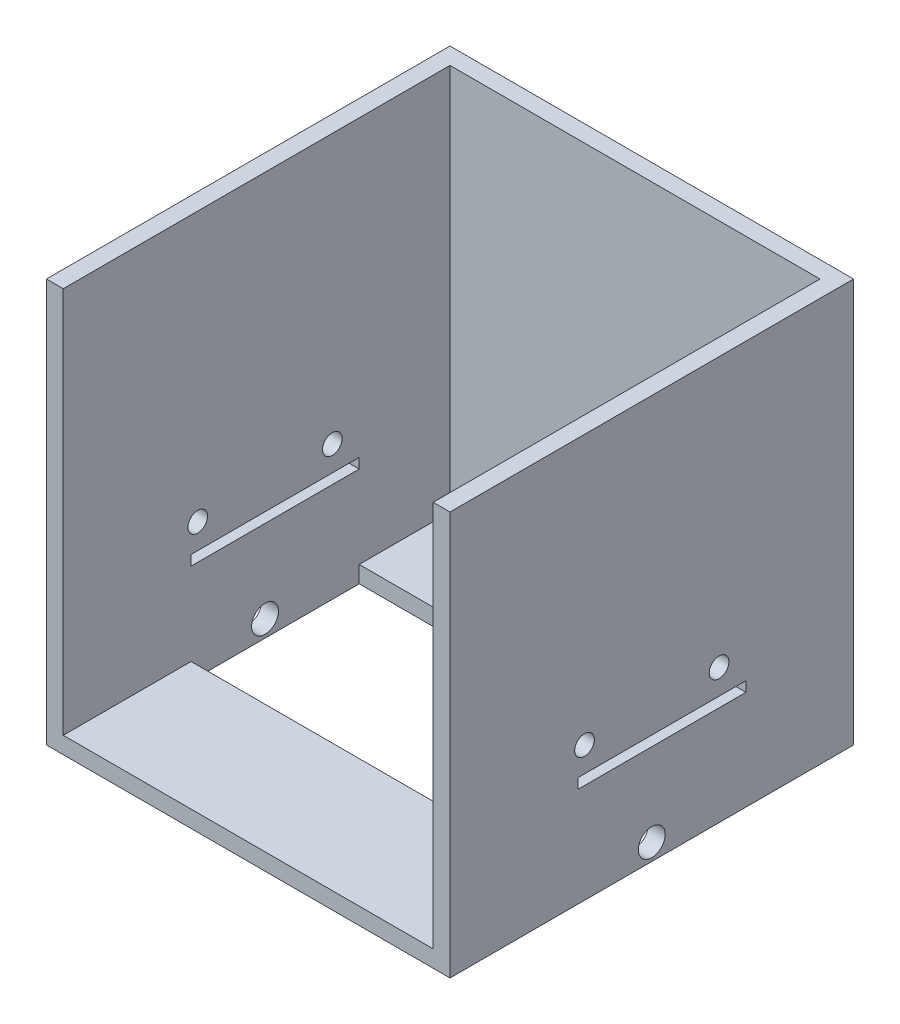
ISO-10303-21;
HEADER;
FILE_DESCRIPTION(('STEP AP214'),'2;1');
FILE_NAME('part.step','',(''),(''),'','','');
FILE_SCHEMA(('AUTOMOTIVE_DESIGN { 1 0 10303 214 1 1 1 1 }'));
ENDSEC;
DATA;
#1=APPLICATION_CONTEXT('core data for automotive mechanical design processes');
#2=APPLICATION_PROTOCOL_DEFINITION('international standard','automotive_design',2000,#1);
#3=PRODUCT_CONTEXT('',#1,'mechanical');
#4=PRODUCT('Part','Part','',(#3));
#5=PRODUCT_RELATED_PRODUCT_CATEGORY('part','',(#4));
#6=PRODUCT_DEFINITION_FORMATION('','',#4);
#7=PRODUCT_DEFINITION_CONTEXT('part definition',#1,'design');
#8=PRODUCT_DEFINITION('design','',#6,#7);
#9=PRODUCT_DEFINITION_SHAPE('','',#8);
#10=(LENGTH_UNIT() NAMED_UNIT(*) SI_UNIT(.MILLI.,.METRE.));
#11=(NAMED_UNIT(*) PLANE_ANGLE_UNIT() SI_UNIT($,.RADIAN.));
#12=(NAMED_UNIT(*) SI_UNIT($,.STERADIAN.) SOLID_ANGLE_UNIT());
#13=UNCERTAINTY_MEASURE_WITH_UNIT(LENGTH_MEASURE(1.E-05),#10,'distance_accuracy_value','');
#14=(GEOMETRIC_REPRESENTATION_CONTEXT(3) GLOBAL_UNCERTAINTY_ASSIGNED_CONTEXT((#13)) GLOBAL_UNIT_ASSIGNED_CONTEXT((#10,
#11,#12)) REPRESENTATION_CONTEXT('',''));
#15=CARTESIAN_POINT('',(0.,0.,0.));
#16=DIRECTION('',(0.,0.,1.));
#17=DIRECTION('',(1.,0.,0.));
#18=AXIS2_PLACEMENT_3D('',#15,#16,#17);
#19=CARTESIAN_POINT('',(60.,4.99819999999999,0.));
#20=DIRECTION('',(-1.,0.,0.));
#21=DIRECTION('',(0.,0.,1.));
#22=AXIS2_PLACEMENT_3D('',#19,#20,#21);
#23=CYLINDRICAL_SURFACE('',#22,4.);
#24=CARTESIAN_POINT('',(60.,4.99819999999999,0.));
#25=DIRECTION('',(-1.,0.,0.));
#26=DIRECTION('',(0.,0.,1.));
#27=AXIS2_PLACEMENT_3D('',#24,#25,#26);
#28=CIRCLE('',#27,4.);
#29=CARTESIAN_POINT('',(60.,4.99819999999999,3.99999999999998));
#30=VERTEX_POINT('',#29);
#31=EDGE_CURVE('E377',#30,#30,#28,.T.);
#32=CARTESIAN_POINT('',(55.,4.99819999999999,0.));
#33=DIRECTION('',(1.,0.,0.));
#34=DIRECTION('',(0.,0.,-1.));
#35=AXIS2_PLACEMENT_3D('',#32,#33,#34);
#36=CIRCLE('',#35,4.);
#37=CARTESIAN_POINT('',(55.,4.99819999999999,3.99999999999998));
#38=VERTEX_POINT('',#37);
#39=EDGE_CURVE('E380',#38,#38,#36,.T.);
#40=CARTESIAN_POINT('',(60.,4.99819999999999,3.99999999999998));
#41=CARTESIAN_POINT('',(59.9479166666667,4.99819999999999,3.99999999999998));
#42=CARTESIAN_POINT('',(59.8958333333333,4.99819999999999,3.99999999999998));
#43=CARTESIAN_POINT('',(59.7916666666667,4.99819999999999,3.99999999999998));
#44=CARTESIAN_POINT('',(59.7395833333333,4.99819999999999,3.99999999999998));
#45=CARTESIAN_POINT('',(59.6354166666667,4.99819999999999,3.99999999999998));
#46=CARTESIAN_POINT('',(59.5833333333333,4.99819999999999,3.99999999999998));
#47=CARTESIAN_POINT('',(59.4791666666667,4.99819999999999,3.99999999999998));
#48=CARTESIAN_POINT('',(59.4270833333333,4.99819999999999,3.99999999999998));
#49=CARTESIAN_POINT('',(59.3229166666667,4.99819999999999,3.99999999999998));
#50=CARTESIAN_POINT('',(59.2708333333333,4.99819999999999,3.99999999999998));
#51=CARTESIAN_POINT('',(59.1666666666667,4.99819999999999,3.99999999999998));
#52=CARTESIAN_POINT('',(59.1145833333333,4.99819999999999,3.99999999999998));
#53=CARTESIAN_POINT('',(59.0104166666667,4.99819999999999,3.99999999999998));
#54=CARTESIAN_POINT('',(58.9583333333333,4.99819999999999,3.99999999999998));
#55=CARTESIAN_POINT('',(58.8541666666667,4.99819999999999,3.99999999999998));
#56=CARTESIAN_POINT('',(58.8020833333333,4.99819999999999,3.99999999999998));
#57=CARTESIAN_POINT('',(58.6979166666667,4.99819999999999,3.99999999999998));
#58=CARTESIAN_POINT('',(58.6458333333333,4.99819999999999,3.99999999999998));
#59=CARTESIAN_POINT('',(58.5416666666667,4.99819999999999,3.99999999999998));
#60=CARTESIAN_POINT('',(58.4895833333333,4.99819999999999,3.99999999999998));
#61=CARTESIAN_POINT('',(58.3854166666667,4.99819999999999,3.99999999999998));
#62=CARTESIAN_POINT('',(58.3333333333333,4.99819999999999,3.99999999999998));
#63=CARTESIAN_POINT('',(58.2291666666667,4.99819999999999,3.99999999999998));
#64=CARTESIAN_POINT('',(58.1770833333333,4.99819999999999,3.99999999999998));
#65=CARTESIAN_POINT('',(58.0729166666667,4.99819999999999,3.99999999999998));
#66=CARTESIAN_POINT('',(58.0208333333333,4.99819999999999,3.99999999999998));
#67=CARTESIAN_POINT('',(57.9166666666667,4.99819999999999,3.99999999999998));
#68=CARTESIAN_POINT('',(57.8645833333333,4.99819999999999,3.99999999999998));
#69=CARTESIAN_POINT('',(57.7604166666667,4.99819999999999,3.99999999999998));
#70=CARTESIAN_POINT('',(57.7083333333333,4.99819999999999,3.99999999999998));
#71=CARTESIAN_POINT('',(57.6041666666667,4.99819999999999,3.99999999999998));
#72=CARTESIAN_POINT('',(57.5520833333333,4.99819999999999,3.99999999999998));
#73=CARTESIAN_POINT('',(57.4479166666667,4.99819999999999,3.99999999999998));
#74=CARTESIAN_POINT('',(57.3958333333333,4.99819999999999,3.99999999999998));
#75=CARTESIAN_POINT('',(57.2916666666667,4.99819999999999,3.99999999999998));
#76=CARTESIAN_POINT('',(57.2395833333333,4.99819999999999,3.99999999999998));
#77=CARTESIAN_POINT('',(57.1354166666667,4.99819999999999,3.99999999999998));
#78=CARTESIAN_POINT('',(57.0833333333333,4.99819999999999,3.99999999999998));
#79=CARTESIAN_POINT('',(56.9791666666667,4.99819999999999,3.99999999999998));
#80=CARTESIAN_POINT('',(56.9270833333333,4.99819999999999,3.99999999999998));
#81=CARTESIAN_POINT('',(56.8229166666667,4.99819999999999,3.99999999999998));
#82=CARTESIAN_POINT('',(56.7708333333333,4.99819999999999,3.99999999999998));
#83=CARTESIAN_POINT('',(56.6666666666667,4.99819999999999,3.99999999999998));
#84=CARTESIAN_POINT('',(56.6145833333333,4.99819999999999,3.99999999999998));
#85=CARTESIAN_POINT('',(56.5104166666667,4.99819999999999,3.99999999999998));
#86=CARTESIAN_POINT('',(56.4583333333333,4.99819999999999,3.99999999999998));
#87=CARTESIAN_POINT('',(56.3541666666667,4.99819999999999,3.99999999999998));
#88=CARTESIAN_POINT('',(56.3020833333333,4.99819999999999,3.99999999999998));
#89=CARTESIAN_POINT('',(56.1979166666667,4.99819999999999,3.99999999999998));
#90=CARTESIAN_POINT('',(56.1458333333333,4.99819999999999,3.99999999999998));
#91=CARTESIAN_POINT('',(56.0416666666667,4.99819999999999,3.99999999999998));
#92=CARTESIAN_POINT('',(55.9895833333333,4.99819999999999,3.99999999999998));
#93=CARTESIAN_POINT('',(55.8854166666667,4.99819999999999,3.99999999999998));
#94=CARTESIAN_POINT('',(55.8333333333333,4.99819999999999,3.99999999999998));
#95=CARTESIAN_POINT('',(55.7291666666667,4.99819999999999,3.99999999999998));
#96=CARTESIAN_POINT('',(55.6770833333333,4.99819999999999,3.99999999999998));
#97=CARTESIAN_POINT('',(55.5729166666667,4.99819999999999,3.99999999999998));
#98=CARTESIAN_POINT('',(55.5208333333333,4.99819999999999,3.99999999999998));
#99=CARTESIAN_POINT('',(55.4166666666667,4.99819999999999,3.99999999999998));
#100=CARTESIAN_POINT('',(55.3645833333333,4.99819999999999,3.99999999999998));
#101=CARTESIAN_POINT('',(55.2604166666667,4.99819999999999,3.99999999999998));
#102=CARTESIAN_POINT('',(55.2083333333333,4.99819999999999,3.99999999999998));
#103=CARTESIAN_POINT('',(55.1041666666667,4.99819999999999,3.99999999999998));
#104=CARTESIAN_POINT('',(55.0520833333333,4.99819999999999,3.99999999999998));
#105=CARTESIAN_POINT('',(55.,4.99819999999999,3.99999999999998));
#106=B_SPLINE_CURVE_WITH_KNOTS('',3,(#40,#41,#42,#43,#44,#45,#46,#47,#48,#49,#50,#51,#52,#53,
#54,#55,#56,#57,#58,#59,#60,#61,#62,#63,#64,#65,#66,#67,#68,#69,#70,#71,#72,#73,#74,#75,#76,#77,
#78,#79,#80,#81,#82,#83,#84,#85,#86,#87,#88,#89,#90,#91,#92,#93,#94,#95,#96,#97,#98,#99,#100,
#101,#102,#103,#104,#105),.UNSPECIFIED.,.F.,.F.,(4,2,2,2,2,2,2,2,2,2,2,2,2,2,2,2,2,2,2,2,2,2,2,
2,2,2,2,2,2,2,2,2,4),(0.,0.156250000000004,0.312500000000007,0.468750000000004,
0.625000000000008,0.781250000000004,0.937500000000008,1.09375,1.25000000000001,1.40625,
1.56250000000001,1.71875,1.87500000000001,2.03125000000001,2.18750000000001,2.34375000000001,
2.50000000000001,2.65625000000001,2.81250000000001,2.96875000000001,3.12500000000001,
3.28125000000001,3.43750000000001,3.59375000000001,3.75000000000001,3.90625000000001,
4.06250000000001,4.21875000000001,4.37500000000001,4.53125000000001,4.68750000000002,
4.84375000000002,5.00000000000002),.UNSPECIFIED.);
#107=EDGE_CURVE('BSEAM35',#30,#38,#106,.T.);
#108=ORIENTED_EDGE('',*,*,#31,.F.);
#109=ORIENTED_EDGE('',*,*,#39,.F.);
#110=ORIENTED_EDGE('',*,*,#107,.T.);
#111=ORIENTED_EDGE('',*,*,#107,.F.);
#112=EDGE_LOOP('',(#108,#110,#109,#111));
#113=FACE_BOUND('',#112,.T.);
#114=ADVANCED_FACE('F35',(#113),#23,.F.);
#115=CARTESIAN_POINT('',(0.,4.99999999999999,0.));
#116=DIRECTION('',(0.,-1.,0.));
#117=DIRECTION('',(0.,0.,-1.));
#118=AXIS2_PLACEMENT_3D('',#115,#116,#117);
#119=PLANE('',#118);
#120=DIRECTION('',(0.,0.,-1.));
#121=VECTOR('',#120,1.);
#122=CARTESIAN_POINT('',(55.,4.99999999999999,60.));
#123=LINE('',#122,#121);
#124=CARTESIAN_POINT('',(55.,4.99999999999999,60.));
#125=VERTEX_POINT('',#124);
#126=CARTESIAN_POINT('',(55.,4.99999999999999,22.));
#127=VERTEX_POINT('',#126);
#128=EDGE_CURVE('E195',#125,#127,#123,.T.);
#129=ORIENTED_EDGE('',*,*,#128,.T.);
#130=DIRECTION('',(1.,0.,0.));
#131=VECTOR('',#130,1.);
#132=CARTESIAN_POINT('',(-55.,4.99999999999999,22.));
#133=LINE('',#132,#131);
#134=CARTESIAN_POINT('',(-55.,4.99999999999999,22.));
#135=VERTEX_POINT('',#134);
#136=EDGE_CURVE('E181',#135,#127,#133,.T.);
#137=ORIENTED_EDGE('',*,*,#136,.F.);
#138=DIRECTION('',(0.,0.,1.));
#139=VECTOR('',#138,1.);
#140=CARTESIAN_POINT('',(-55.,4.99999999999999,60.));
#141=LINE('',#140,#139);
#142=CARTESIAN_POINT('',(-55.,4.99999999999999,60.));
#143=VERTEX_POINT('',#142);
#144=EDGE_CURVE('E214',#135,#143,#141,.T.);
#145=ORIENTED_EDGE('',*,*,#144,.T.);
#146=DIRECTION('',(1.,0.,0.));
#147=VECTOR('',#146,1.);
#148=CARTESIAN_POINT('',(-55.,4.99999999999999,60.));
#149=LINE('',#148,#147);
#150=EDGE_CURVE('E196',#143,#125,#149,.T.);
#151=ORIENTED_EDGE('',*,*,#150,.T.);
#152=EDGE_LOOP('',(#129,#137,#145,#151));
#153=FACE_BOUND('',#152,.T.);
#154=ADVANCED_FACE('F344',(#153),#119,.F.);
#155=CARTESIAN_POINT('',(60.,120.,-60.));
#156=DIRECTION('',(-1.,0.,0.));
#157=DIRECTION('',(0.,0.,1.));
#158=AXIS2_PLACEMENT_3D('',#155,#156,#157);
#159=PLANE('',#158);
#160=ORIENTED_EDGE('',*,*,#31,.T.);
#161=EDGE_LOOP('',(#160));
#162=FACE_BOUND('',#161,.T.);
#163=CARTESIAN_POINT('',(60.,40.,-20.));
#164=DIRECTION('',(-1.,0.,0.));
#165=DIRECTION('',(0.,0.,1.));
#166=AXIS2_PLACEMENT_3D('',#163,#164,#165);
#167=CIRCLE('',#166,2.921);
#168=CARTESIAN_POINT('',(60.,40.,-17.079));
#169=VERTEX_POINT('',#168);
#170=EDGE_CURVE('E271',#169,#169,#167,.T.);
#171=ORIENTED_EDGE('',*,*,#170,.T.);
#172=EDGE_LOOP('',(#171));
#173=FACE_BOUND('',#172,.T.);
#174=DIRECTION('',(0.,0.,-1.));
#175=VECTOR('',#174,1.);
#176=CARTESIAN_POINT('',(60.,32.56,-28.));
#177=LINE('',#176,#175);
#178=CARTESIAN_POINT('',(60.,32.56,22.));
#179=VERTEX_POINT('',#178);
#180=CARTESIAN_POINT('',(60.,32.56,-28.));
#181=VERTEX_POINT('',#180);
#182=EDGE_CURVE('E296',#179,#181,#177,.T.);
#183=ORIENTED_EDGE('',*,*,#182,.T.);
#184=DIRECTION('',(0.,-1.,0.));
#185=VECTOR('',#184,1.);
#186=CARTESIAN_POINT('',(60.,29.56,-28.));
#187=LINE('',#186,#185);
#188=CARTESIAN_POINT('',(60.,29.56,-28.));
#189=VERTEX_POINT('',#188);
#190=EDGE_CURVE('E288',#181,#189,#187,.T.);
#191=ORIENTED_EDGE('',*,*,#190,.T.);
#192=DIRECTION('',(0.,0.,1.));
#193=VECTOR('',#192,1.);
#194=CARTESIAN_POINT('',(60.,29.56,-28.));
#195=LINE('',#194,#193);
#196=CARTESIAN_POINT('',(60.,29.56,22.));
#197=VERTEX_POINT('',#196);
#198=EDGE_CURVE('E291',#189,#197,#195,.T.);
#199=ORIENTED_EDGE('',*,*,#198,.T.);
#200=DIRECTION('',(0.,1.,0.));
#201=VECTOR('',#200,1.);
#202=CARTESIAN_POINT('',(60.,29.56,22.));
#203=LINE('',#202,#201);
#204=EDGE_CURVE('E58',#197,#179,#203,.T.);
#205=ORIENTED_EDGE('',*,*,#204,.T.);
#206=EDGE_LOOP('',(#183,#191,#199,#205));
#207=FACE_BOUND('',#206,.T.);
#208=CARTESIAN_POINT('',(60.,40.,20.));
#209=DIRECTION('',(-1.,0.,0.));
#210=DIRECTION('',(0.,0.,1.));
#211=AXIS2_PLACEMENT_3D('',#208,#209,#210);
#212=CIRCLE('',#211,2.92100000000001);
#213=CARTESIAN_POINT('',(60.,40.,22.921));
#214=VERTEX_POINT('',#213);
#215=EDGE_CURVE('E258',#214,#214,#212,.T.);
#216=ORIENTED_EDGE('',*,*,#215,.T.);
#217=EDGE_LOOP('',(#216));
#218=FACE_BOUND('',#217,.T.);
#219=DIRECTION('',(0.,0.,-1.));
#220=VECTOR('',#219,1.);
#221=CARTESIAN_POINT('',(60.,0.,-60.));
#222=LINE('',#221,#220);
#223=CARTESIAN_POINT('',(60.,0.,60.));
#224=VERTEX_POINT('',#223);
#225=CARTESIAN_POINT('',(60.,0.,-60.));
#226=VERTEX_POINT('',#225);
#227=EDGE_CURVE('E217',#224,#226,#222,.T.);
#228=ORIENTED_EDGE('',*,*,#227,.T.);
#229=DIRECTION('',(0.,-1.,0.));
#230=VECTOR('',#229,1.);
#231=CARTESIAN_POINT('',(60.,120.,-60.));
#232=LINE('',#231,#230);
#233=CARTESIAN_POINT('',(60.,120.,-60.));
#234=VERTEX_POINT('',#233);
#235=EDGE_CURVE('E251',#234,#226,#232,.T.);
#236=ORIENTED_EDGE('',*,*,#235,.F.);
#237=DIRECTION('',(0.,0.,-1.));
#238=VECTOR('',#237,1.);
#239=CARTESIAN_POINT('',(60.,120.,-60.));
#240=LINE('',#239,#238);
#241=CARTESIAN_POINT('',(60.,120.,60.));
#242=VERTEX_POINT('',#241);
#243=EDGE_CURVE('E223',#242,#234,#240,.T.);
#244=ORIENTED_EDGE('',*,*,#243,.F.);
#245=DIRECTION('',(0.,-1.,0.));
#246=VECTOR('',#245,1.);
#247=CARTESIAN_POINT('',(60.,120.,60.));
#248=LINE('',#247,#246);
#249=EDGE_CURVE('E235',#242,#224,#248,.T.);
#250=ORIENTED_EDGE('',*,*,#249,.T.);
#251=EDGE_LOOP('',(#228,#236,#244,#250));
#252=FACE_BOUND('',#251,.T.);
#253=ADVANCED_FACE('F37',(#162,#173,#207,#218,#252),#159,.F.);
#254=CARTESIAN_POINT('',(-60.,120.,-60.));
#255=DIRECTION('',(0.,0.,1.));
#256=DIRECTION('',(1.,0.,0.));
#257=AXIS2_PLACEMENT_3D('',#254,#255,#256);
#258=PLANE('',#257);
#259=DIRECTION('',(-1.,0.,0.));
#260=VECTOR('',#259,1.);
#261=CARTESIAN_POINT('',(-60.,0.,-60.));
#262=LINE('',#261,#260);
#263=CARTESIAN_POINT('',(-60.,0.,-60.));
#264=VERTEX_POINT('',#263);
#265=EDGE_CURVE('E238',#226,#264,#262,.T.);
#266=ORIENTED_EDGE('',*,*,#265,.T.);
#267=DIRECTION('',(0.,-1.,0.));
#268=VECTOR('',#267,1.);
#269=CARTESIAN_POINT('',(-60.,120.,-60.));
#270=LINE('',#269,#268);
#271=CARTESIAN_POINT('',(-60.,120.,-60.));
#272=VERTEX_POINT('',#271);
#273=EDGE_CURVE('E248',#272,#264,#270,.T.);
#274=ORIENTED_EDGE('',*,*,#273,.F.);
#275=DIRECTION('',(-1.,0.,0.));
#276=VECTOR('',#275,1.);
#277=CARTESIAN_POINT('',(-60.,120.,-60.));
#278=LINE('',#277,#276);
#279=EDGE_CURVE('E226',#234,#272,#278,.T.);
#280=ORIENTED_EDGE('',*,*,#279,.F.);
#281=ORIENTED_EDGE('',*,*,#235,.T.);
#282=EDGE_LOOP('',(#266,#274,#280,#281));
#283=FACE_BOUND('',#282,.T.);
#284=ADVANCED_FACE('F415',(#283),#258,.F.);
#285=CARTESIAN_POINT('',(-60.,120.,-60.));
#286=DIRECTION('',(1.,0.,0.));
#287=DIRECTION('',(0.,0.,-1.));
#288=AXIS2_PLACEMENT_3D('',#285,#286,#287);
#289=PLANE('',#288);
#290=CARTESIAN_POINT('',(-60.,4.99819999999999,0.));
#291=DIRECTION('',(-1.,0.,0.));
#292=DIRECTION('',(0.,0.,1.));
#293=AXIS2_PLACEMENT_3D('',#290,#291,#292);
#294=CIRCLE('',#293,4.);
#295=CARTESIAN_POINT('',(-60.,4.99819999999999,3.99999999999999));
#296=VERTEX_POINT('',#295);
#297=EDGE_CURVE('E376',#296,#296,#294,.T.);
#298=ORIENTED_EDGE('',*,*,#297,.F.);
#299=EDGE_LOOP('',(#298));
#300=FACE_BOUND('',#299,.T.);
#301=CARTESIAN_POINT('',(-60.,40.,-20.));
#302=DIRECTION('',(-1.,0.,0.));
#303=DIRECTION('',(0.,0.,1.));
#304=AXIS2_PLACEMENT_3D('',#301,#302,#303);
#305=CIRCLE('',#304,2.921);
#306=CARTESIAN_POINT('',(-60.,40.,-17.079));
#307=VERTEX_POINT('',#306);
#308=EDGE_CURVE('E278',#307,#307,#305,.T.);
#309=ORIENTED_EDGE('',*,*,#308,.F.);
#310=EDGE_LOOP('',(#309));
#311=FACE_BOUND('',#310,.T.);
#312=DIRECTION('',(0.,0.,1.));
#313=VECTOR('',#312,1.);
#314=CARTESIAN_POINT('',(-60.,29.56,-28.));
#315=LINE('',#314,#313);
#316=CARTESIAN_POINT('',(-60.,29.56,-28.));
#317=VERTEX_POINT('',#316);
#318=CARTESIAN_POINT('',(-60.,29.56,22.));
#319=VERTEX_POINT('',#318);
#320=EDGE_CURVE('E301',#317,#319,#315,.T.);
#321=ORIENTED_EDGE('',*,*,#320,.F.);
#322=DIRECTION('',(0.,-1.,0.));
#323=VECTOR('',#322,1.);
#324=CARTESIAN_POINT('',(-60.,29.56,-28.));
#325=LINE('',#324,#323);
#326=CARTESIAN_POINT('',(-60.,32.56,-28.));
#327=VERTEX_POINT('',#326);
#328=EDGE_CURVE('E275',#327,#317,#325,.T.);
#329=ORIENTED_EDGE('',*,*,#328,.F.);
#330=DIRECTION('',(0.,0.,-1.));
#331=VECTOR('',#330,1.);
#332=CARTESIAN_POINT('',(-60.,32.56,-28.));
#333=LINE('',#332,#331);
#334=CARTESIAN_POINT('',(-60.,32.56,22.));
#335=VERTEX_POINT('',#334);
#336=EDGE_CURVE('E292',#335,#327,#333,.T.);
#337=ORIENTED_EDGE('',*,*,#336,.F.);
#338=DIRECTION('',(0.,1.,0.));
#339=VECTOR('',#338,1.);
#340=CARTESIAN_POINT('',(-60.,29.56,22.));
#341=LINE('',#340,#339);
#342=EDGE_CURVE('E304',#319,#335,#341,.T.);
#343=ORIENTED_EDGE('',*,*,#342,.F.);
#344=EDGE_LOOP('',(#321,#329,#337,#343));
#345=FACE_BOUND('',#344,.T.);
#346=CARTESIAN_POINT('',(-60.,40.,20.));
#347=DIRECTION('',(-1.,0.,0.));
#348=DIRECTION('',(0.,0.,1.));
#349=AXIS2_PLACEMENT_3D('',#346,#347,#348);
#350=CIRCLE('',#349,2.92100000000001);
#351=CARTESIAN_POINT('',(-60.,40.,22.921));
#352=VERTEX_POINT('',#351);
#353=EDGE_CURVE('E334',#352,#352,#350,.T.);
#354=ORIENTED_EDGE('',*,*,#353,.F.);
#355=EDGE_LOOP('',(#354));
#356=FACE_BOUND('',#355,.T.);
#357=DIRECTION('',(0.,0.,1.));
#358=VECTOR('',#357,1.);
#359=CARTESIAN_POINT('',(-60.,0.,-60.));
#360=LINE('',#359,#358);
#361=CARTESIAN_POINT('',(-60.,0.,60.));
#362=VERTEX_POINT('',#361);
#363=EDGE_CURVE('E240',#264,#362,#360,.T.);
#364=ORIENTED_EDGE('',*,*,#363,.T.);
#365=DIRECTION('',(0.,-1.,0.));
#366=VECTOR('',#365,1.);
#367=CARTESIAN_POINT('',(-60.,120.,60.));
#368=LINE('',#367,#366);
#369=CARTESIAN_POINT('',(-60.,120.,60.));
#370=VERTEX_POINT('',#369);
#371=EDGE_CURVE('E245',#370,#362,#368,.T.);
#372=ORIENTED_EDGE('',*,*,#371,.F.);
#373=DIRECTION('',(0.,0.,1.));
#374=VECTOR('',#373,1.);
#375=CARTESIAN_POINT('',(-60.,120.,-60.));
#376=LINE('',#375,#374);
#377=EDGE_CURVE('E229',#272,#370,#376,.T.);
#378=ORIENTED_EDGE('',*,*,#377,.F.);
#379=ORIENTED_EDGE('',*,*,#273,.T.);
#380=EDGE_LOOP('',(#364,#372,#378,#379));
#381=FACE_BOUND('',#380,.T.);
#382=ADVANCED_FACE('F433',(#300,#311,#345,#356,#381),#289,.F.);
#383=CARTESIAN_POINT('',(-60.,120.,60.));
#384=DIRECTION('',(0.,0.,-1.));
#385=DIRECTION('',(-1.,0.,0.));
#386=AXIS2_PLACEMENT_3D('',#383,#384,#385);
#387=PLANE('',#386);
#388=ORIENTED_EDGE('',*,*,#150,.F.);
#389=DIRECTION('',(0.,1.,0.));
#390=VECTOR('',#389,1.);
#391=CARTESIAN_POINT('',(-55.,4.99999999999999,60.));
#392=LINE('',#391,#390);
#393=CARTESIAN_POINT('',(-55.,120.,60.));
#394=VERTEX_POINT('',#393);
#395=EDGE_CURVE('E205',#143,#394,#392,.T.);
#396=ORIENTED_EDGE('',*,*,#395,.T.);
#397=DIRECTION('',(1.,0.,0.));
#398=VECTOR('',#397,1.);
#399=CARTESIAN_POINT('',(-60.,120.,60.));
#400=LINE('',#399,#398);
#401=EDGE_CURVE('E232',#370,#394,#400,.T.);
#402=ORIENTED_EDGE('',*,*,#401,.F.);
#403=ORIENTED_EDGE('',*,*,#371,.T.);
#404=DIRECTION('',(1.,0.,0.));
#405=VECTOR('',#404,1.);
#406=CARTESIAN_POINT('',(-60.,0.,60.));
#407=LINE('',#406,#405);
#408=EDGE_CURVE('E227',#362,#224,#407,.T.);
#409=ORIENTED_EDGE('',*,*,#408,.T.);
#410=ORIENTED_EDGE('',*,*,#249,.F.);
#411=CARTESIAN_POINT('',(55.,120.,60.));
#412=VERTEX_POINT('',#411);
#413=EDGE_CURVE('E231',#412,#242,#400,.T.);
#414=ORIENTED_EDGE('',*,*,#413,.F.);
#415=DIRECTION('',(0.,1.,0.));
#416=VECTOR('',#415,1.);
#417=CARTESIAN_POINT('',(55.,4.99999999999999,60.));
#418=LINE('',#417,#416);
#419=EDGE_CURVE('E219',#125,#412,#418,.T.);
#420=ORIENTED_EDGE('',*,*,#419,.F.);
#421=EDGE_LOOP('',(#388,#396,#402,#403,#409,#410,#414,#420));
#422=FACE_BOUND('',#421,.T.);
#423=ADVANCED_FACE('F355',(#422),#387,.F.);
#424=CARTESIAN_POINT('',(0.,120.,0.));
#425=DIRECTION('',(0.,1.,0.));
#426=DIRECTION('',(0.,0.,1.));
#427=AXIS2_PLACEMENT_3D('',#424,#425,#426);
#428=PLANE('',#427);
#429=DIRECTION('',(0.,0.,1.));
#430=VECTOR('',#429,1.);
#431=CARTESIAN_POINT('',(-55.,120.,60.));
#432=LINE('',#431,#430);
#433=CARTESIAN_POINT('',(-55.,120.,-55.));
#434=VERTEX_POINT('',#433);
#435=EDGE_CURVE('E206',#434,#394,#432,.T.);
#436=ORIENTED_EDGE('',*,*,#435,.F.);
#437=DIRECTION('',(-1.,0.,0.));
#438=VECTOR('',#437,1.);
#439=CARTESIAN_POINT('',(-55.,120.,-55.));
#440=LINE('',#439,#438);
#441=CARTESIAN_POINT('',(55.,120.,-55.));
#442=VERTEX_POINT('',#441);
#443=EDGE_CURVE('E211',#442,#434,#440,.T.);
#444=ORIENTED_EDGE('',*,*,#443,.F.);
#445=DIRECTION('',(0.,0.,-1.));
#446=VECTOR('',#445,1.);
#447=CARTESIAN_POINT('',(55.,120.,60.));
#448=LINE('',#447,#446);
#449=EDGE_CURVE('E208',#412,#442,#448,.T.);
#450=ORIENTED_EDGE('',*,*,#449,.F.);
#451=ORIENTED_EDGE('',*,*,#413,.T.);
#452=ORIENTED_EDGE('',*,*,#243,.T.);
#453=ORIENTED_EDGE('',*,*,#279,.T.);
#454=ORIENTED_EDGE('',*,*,#377,.T.);
#455=ORIENTED_EDGE('',*,*,#401,.T.);
#456=EDGE_LOOP('',(#436,#444,#450,#451,#452,#453,#454,#455));
#457=FACE_BOUND('',#456,.T.);
#458=ADVANCED_FACE('F361',(#457),#428,.T.);
#459=CARTESIAN_POINT('',(0.,0.,0.));
#460=DIRECTION('',(0.,1.,0.));
#461=DIRECTION('',(0.,0.,1.));
#462=AXIS2_PLACEMENT_3D('',#459,#460,#461);
#463=PLANE('',#462);
#464=DIRECTION('',(1.,0.,0.));
#465=VECTOR('',#464,1.);
#466=CARTESIAN_POINT('',(0.,0.,22.));
#467=LINE('',#466,#465);
#468=CARTESIAN_POINT('',(-55.,0.,22.));
#469=VERTEX_POINT('',#468);
#470=CARTESIAN_POINT('',(55.,0.,22.));
#471=VERTEX_POINT('',#470);
#472=EDGE_CURVE('E11',#469,#471,#467,.T.);
#473=ORIENTED_EDGE('',*,*,#472,.T.);
#474=DIRECTION('',(0.,0.,-1.));
#475=VECTOR('',#474,1.);
#476=CARTESIAN_POINT('',(55.,0.,0.));
#477=LINE('',#476,#475);
#478=CARTESIAN_POINT('',(55.,0.,-28.));
#479=VERTEX_POINT('',#478);
#480=EDGE_CURVE('E373',#471,#479,#477,.T.);
#481=ORIENTED_EDGE('',*,*,#480,.T.);
#482=DIRECTION('',(-1.,0.,0.));
#483=VECTOR('',#482,1.);
#484=CARTESIAN_POINT('',(0.,0.,-28.));
#485=LINE('',#484,#483);
#486=CARTESIAN_POINT('',(-55.,0.,-28.));
#487=VERTEX_POINT('',#486);
#488=EDGE_CURVE('E177',#479,#487,#485,.T.);
#489=ORIENTED_EDGE('',*,*,#488,.T.);
#490=DIRECTION('',(0.,0.,1.));
#491=VECTOR('',#490,1.);
#492=CARTESIAN_POINT('',(-55.,0.,0.));
#493=LINE('',#492,#491);
#494=EDGE_CURVE('E365',#487,#469,#493,.T.);
#495=ORIENTED_EDGE('',*,*,#494,.T.);
#496=EDGE_LOOP('',(#473,#481,#489,#495));
#497=FACE_BOUND('',#496,.T.);
#498=ORIENTED_EDGE('',*,*,#227,.F.);
#499=ORIENTED_EDGE('',*,*,#408,.F.);
#500=ORIENTED_EDGE('',*,*,#363,.F.);
#501=ORIENTED_EDGE('',*,*,#265,.F.);
#502=EDGE_LOOP('',(#498,#499,#500,#501));
#503=FACE_BOUND('',#502,.T.);
#504=ADVANCED_FACE('F426',(#497,#503),#463,.F.);
#505=CARTESIAN_POINT('',(-55.,4.99999999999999,60.));
#506=DIRECTION('',(-1.,0.,0.));
#507=DIRECTION('',(0.,0.,1.));
#508=AXIS2_PLACEMENT_3D('',#505,#506,#507);
#509=PLANE('',#508);
#510=ORIENTED_EDGE('',*,*,#144,.F.);
#511=DIRECTION('',(0.,1.,0.));
#512=VECTOR('',#511,1.);
#513=CARTESIAN_POINT('',(-55.,-5.00000000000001,22.));
#514=LINE('',#513,#512);
#515=EDGE_CURVE('E366',#469,#135,#514,.T.);
#516=ORIENTED_EDGE('',*,*,#515,.F.);
#517=ORIENTED_EDGE('',*,*,#494,.F.);
#518=DIRECTION('',(0.,1.,0.));
#519=VECTOR('',#518,1.);
#520=CARTESIAN_POINT('',(-55.,-5.00000000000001,-28.));
#521=LINE('',#520,#519);
#522=CARTESIAN_POINT('',(-55.,4.99999999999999,-28.));
#523=VERTEX_POINT('',#522);
#524=EDGE_CURVE('E50',#487,#523,#521,.T.);
#525=ORIENTED_EDGE('',*,*,#524,.T.);
#526=CARTESIAN_POINT('',(-55.,4.99999999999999,-55.));
#527=VERTEX_POINT('',#526);
#528=EDGE_CURVE('E189',#527,#523,#141,.T.);
#529=ORIENTED_EDGE('',*,*,#528,.F.);
#530=DIRECTION('',(0.,1.,0.));
#531=VECTOR('',#530,1.);
#532=CARTESIAN_POINT('',(-55.,4.99999999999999,-55.));
#533=LINE('',#532,#531);
#534=EDGE_CURVE('E215',#527,#434,#533,.T.);
#535=ORIENTED_EDGE('',*,*,#534,.T.);
#536=ORIENTED_EDGE('',*,*,#435,.T.);
#537=ORIENTED_EDGE('',*,*,#395,.F.);
#538=EDGE_LOOP('',(#510,#516,#517,#525,#529,#535,#536,#537));
#539=FACE_BOUND('',#538,.T.);
#540=CARTESIAN_POINT('',(-55.,40.,-20.));
#541=DIRECTION('',(-1.,0.,0.));
#542=DIRECTION('',(0.,0.,1.));
#543=AXIS2_PLACEMENT_3D('',#540,#541,#542);
#544=CIRCLE('',#543,2.921);
#545=CARTESIAN_POINT('',(-55.,40.,-17.079));
#546=VERTEX_POINT('',#545);
#547=EDGE_CURVE('E270',#546,#546,#544,.T.);
#548=ORIENTED_EDGE('',*,*,#547,.T.);
#549=EDGE_LOOP('',(#548));
#550=FACE_BOUND('',#549,.T.);
#551=DIRECTION('',(0.,0.,-1.));
#552=VECTOR('',#551,1.);
#553=CARTESIAN_POINT('',(-55.,32.56,60.));
#554=LINE('',#553,#552);
#555=CARTESIAN_POINT('',(-55.,32.56,22.));
#556=VERTEX_POINT('',#555);
#557=CARTESIAN_POINT('',(-55.,32.56,-28.));
#558=VERTEX_POINT('',#557);
#559=EDGE_CURVE('E328',#556,#558,#554,.T.);
#560=ORIENTED_EDGE('',*,*,#559,.T.);
#561=DIRECTION('',(0.,-1.,0.));
#562=VECTOR('',#561,1.);
#563=CARTESIAN_POINT('',(-55.,4.99999999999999,-28.));
#564=LINE('',#563,#562);
#565=CARTESIAN_POINT('',(-55.,29.56,-28.));
#566=VERTEX_POINT('',#565);
#567=EDGE_CURVE('E331',#558,#566,#564,.T.);
#568=ORIENTED_EDGE('',*,*,#567,.T.);
#569=DIRECTION('',(0.,0.,1.));
#570=VECTOR('',#569,1.);
#571=CARTESIAN_POINT('',(-55.,29.56,60.));
#572=LINE('',#571,#570);
#573=CARTESIAN_POINT('',(-55.,29.56,22.));
#574=VERTEX_POINT('',#573);
#575=EDGE_CURVE('E312',#566,#574,#572,.T.);
#576=ORIENTED_EDGE('',*,*,#575,.T.);
#577=DIRECTION('',(0.,1.,0.));
#578=VECTOR('',#577,1.);
#579=CARTESIAN_POINT('',(-55.,4.99999999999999,22.));
#580=LINE('',#579,#578);
#581=EDGE_CURVE('E325',#574,#556,#580,.T.);
#582=ORIENTED_EDGE('',*,*,#581,.T.);
#583=EDGE_LOOP('',(#560,#568,#576,#582));
#584=FACE_BOUND('',#583,.T.);
#585=CARTESIAN_POINT('',(-55.,40.,20.));
#586=DIRECTION('',(-1.,0.,0.));
#587=DIRECTION('',(0.,0.,1.));
#588=AXIS2_PLACEMENT_3D('',#585,#586,#587);
#589=CIRCLE('',#588,2.92100000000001);
#590=CARTESIAN_POINT('',(-55.,40.,22.921));
#591=VERTEX_POINT('',#590);
#592=EDGE_CURVE('E209',#591,#591,#589,.T.);
#593=ORIENTED_EDGE('',*,*,#592,.T.);
#594=EDGE_LOOP('',(#593));
#595=FACE_BOUND('',#594,.T.);
#596=CARTESIAN_POINT('',(-55.,4.99819999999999,0.));
#597=DIRECTION('',(-1.,0.,0.));
#598=DIRECTION('',(0.,0.,1.));
#599=AXIS2_PLACEMENT_3D('',#596,#597,#598);
#600=CIRCLE('',#599,4.);
#601=CARTESIAN_POINT('',(-55.,4.99819999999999,3.99999999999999));
#602=VERTEX_POINT('',#601);
#603=EDGE_CURVE('E283',#602,#602,#600,.T.);
#604=ORIENTED_EDGE('',*,*,#603,.T.);
#605=EDGE_LOOP('',(#604));
#606=FACE_BOUND('',#605,.T.);
#607=ADVANCED_FACE('F350',(#539,#550,#584,#595,#606),#509,.F.);
#608=CARTESIAN_POINT('',(-55.,4.99999999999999,-55.));
#609=DIRECTION('',(0.,0.,-1.));
#610=DIRECTION('',(-1.,0.,0.));
#611=AXIS2_PLACEMENT_3D('',#608,#609,#610);
#612=PLANE('',#611);
#613=ORIENTED_EDGE('',*,*,#443,.T.);
#614=ORIENTED_EDGE('',*,*,#534,.F.);
#615=DIRECTION('',(-1.,0.,0.));
#616=VECTOR('',#615,1.);
#617=CARTESIAN_POINT('',(-55.,4.99999999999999,-55.));
#618=LINE('',#617,#616);
#619=CARTESIAN_POINT('',(55.,4.99999999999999,-55.));
#620=VERTEX_POINT('',#619);
#621=EDGE_CURVE('E199',#620,#527,#618,.T.);
#622=ORIENTED_EDGE('',*,*,#621,.F.);
#623=DIRECTION('',(0.,1.,0.));
#624=VECTOR('',#623,1.);
#625=CARTESIAN_POINT('',(55.,4.99999999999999,-55.));
#626=LINE('',#625,#624);
#627=EDGE_CURVE('E193',#620,#442,#626,.T.);
#628=ORIENTED_EDGE('',*,*,#627,.T.);
#629=EDGE_LOOP('',(#613,#614,#622,#628));
#630=FACE_BOUND('',#629,.T.);
#631=ADVANCED_FACE('F363',(#630),#612,.F.);
#632=CARTESIAN_POINT('',(55.,4.99999999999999,60.));
#633=DIRECTION('',(1.,0.,0.));
#634=DIRECTION('',(0.,0.,-1.));
#635=AXIS2_PLACEMENT_3D('',#632,#633,#634);
#636=PLANE('',#635);
#637=ORIENTED_EDGE('',*,*,#39,.T.);
#638=EDGE_LOOP('',(#637));
#639=FACE_BOUND('',#638,.T.);
#640=CARTESIAN_POINT('',(55.,40.,-20.));
#641=DIRECTION('',(1.,0.,0.));
#642=DIRECTION('',(0.,0.,-1.));
#643=AXIS2_PLACEMENT_3D('',#640,#641,#642);
#644=CIRCLE('',#643,2.921);
#645=CARTESIAN_POINT('',(55.,40.,-17.079));
#646=VERTEX_POINT('',#645);
#647=EDGE_CURVE('E268',#646,#646,#644,.T.);
#648=ORIENTED_EDGE('',*,*,#647,.T.);
#649=EDGE_LOOP('',(#648));
#650=FACE_BOUND('',#649,.T.);
#651=DIRECTION('',(0.,0.,-1.));
#652=VECTOR('',#651,1.);
#653=CARTESIAN_POINT('',(55.,29.56,60.));
#654=LINE('',#653,#652);
#655=CARTESIAN_POINT('',(55.,29.56,22.));
#656=VERTEX_POINT('',#655);
#657=CARTESIAN_POINT('',(55.,29.56,-28.));
#658=VERTEX_POINT('',#657);
#659=EDGE_CURVE('E254',#656,#658,#654,.T.);
#660=ORIENTED_EDGE('',*,*,#659,.T.);
#661=DIRECTION('',(0.,1.,0.));
#662=VECTOR('',#661,1.);
#663=CARTESIAN_POINT('',(55.,4.99999999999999,-28.));
#664=LINE('',#663,#662);
#665=CARTESIAN_POINT('',(55.,32.56,-28.));
#666=VERTEX_POINT('',#665);
#667=EDGE_CURVE('E43',#658,#666,#664,.T.);
#668=ORIENTED_EDGE('',*,*,#667,.T.);
#669=DIRECTION('',(0.,0.,1.));
#670=VECTOR('',#669,1.);
#671=CARTESIAN_POINT('',(55.,32.56,60.));
#672=LINE('',#671,#670);
#673=CARTESIAN_POINT('',(55.,32.56,22.));
#674=VERTEX_POINT('',#673);
#675=EDGE_CURVE('E264',#666,#674,#672,.T.);
#676=ORIENTED_EDGE('',*,*,#675,.T.);
#677=DIRECTION('',(0.,-1.,0.));
#678=VECTOR('',#677,1.);
#679=CARTESIAN_POINT('',(55.,4.99999999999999,22.));
#680=LINE('',#679,#678);
#681=EDGE_CURVE('E261',#674,#656,#680,.T.);
#682=ORIENTED_EDGE('',*,*,#681,.T.);
#683=EDGE_LOOP('',(#660,#668,#676,#682));
#684=FACE_BOUND('',#683,.T.);
#685=CARTESIAN_POINT('',(55.,40.,20.));
#686=DIRECTION('',(1.,0.,0.));
#687=DIRECTION('',(0.,0.,-1.));
#688=AXIS2_PLACEMENT_3D('',#685,#686,#687);
#689=CIRCLE('',#688,2.92100000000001);
#690=CARTESIAN_POINT('',(55.,40.,22.921));
#691=VERTEX_POINT('',#690);
#692=EDGE_CURVE('E255',#691,#691,#689,.T.);
#693=ORIENTED_EDGE('',*,*,#692,.T.);
#694=EDGE_LOOP('',(#693));
#695=FACE_BOUND('',#694,.T.);
#696=CARTESIAN_POINT('',(55.,4.99999999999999,-28.));
#697=VERTEX_POINT('',#696);
#698=EDGE_CURVE('E186',#697,#620,#123,.T.);
#699=ORIENTED_EDGE('',*,*,#698,.F.);
#700=DIRECTION('',(0.,1.,0.));
#701=VECTOR('',#700,1.);
#702=CARTESIAN_POINT('',(55.,-5.00000000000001,-28.));
#703=LINE('',#702,#701);
#704=EDGE_CURVE('E171',#479,#697,#703,.T.);
#705=ORIENTED_EDGE('',*,*,#704,.F.);
#706=ORIENTED_EDGE('',*,*,#480,.F.);
#707=DIRECTION('',(0.,1.,0.));
#708=VECTOR('',#707,1.);
#709=CARTESIAN_POINT('',(55.,-5.00000000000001,22.));
#710=LINE('',#709,#708);
#711=EDGE_CURVE('E368',#471,#127,#710,.T.);
#712=ORIENTED_EDGE('',*,*,#711,.T.);
#713=ORIENTED_EDGE('',*,*,#128,.F.);
#714=ORIENTED_EDGE('',*,*,#419,.T.);
#715=ORIENTED_EDGE('',*,*,#449,.T.);
#716=ORIENTED_EDGE('',*,*,#627,.F.);
#717=EDGE_LOOP('',(#699,#705,#706,#712,#713,#714,#715,#716));
#718=FACE_BOUND('',#717,.T.);
#719=ADVANCED_FACE('F191',(#639,#650,#684,#695,#718),#636,.F.);
#720=ORIENTED_EDGE('',*,*,#528,.T.);
#721=DIRECTION('',(-1.,0.,0.));
#722=VECTOR('',#721,1.);
#723=CARTESIAN_POINT('',(-55.,4.99999999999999,-28.));
#724=LINE('',#723,#722);
#725=EDGE_CURVE('E174',#697,#523,#724,.T.);
#726=ORIENTED_EDGE('',*,*,#725,.F.);
#727=ORIENTED_EDGE('',*,*,#698,.T.);
#728=ORIENTED_EDGE('',*,*,#621,.T.);
#729=EDGE_LOOP('',(#720,#726,#727,#728));
#730=FACE_BOUND('',#729,.T.);
#731=ADVANCED_FACE('F184',(#730),#119,.F.);
#732=CARTESIAN_POINT('',(60.,40.,20.));
#733=DIRECTION('',(-1.,0.,0.));
#734=DIRECTION('',(0.,0.,1.));
#735=AXIS2_PLACEMENT_3D('',#732,#733,#734);
#736=CYLINDRICAL_SURFACE('',#735,2.92100000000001);
#737=CARTESIAN_POINT('',(60.,40.,22.921));
#738=CARTESIAN_POINT('',(59.9479166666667,40.,22.921));
#739=CARTESIAN_POINT('',(59.8958333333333,40.,22.921));
#740=CARTESIAN_POINT('',(59.7916666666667,40.,22.921));
#741=CARTESIAN_POINT('',(59.7395833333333,40.,22.921));
#742=CARTESIAN_POINT('',(59.6354166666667,40.,22.921));
#743=CARTESIAN_POINT('',(59.5833333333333,40.,22.921));
#744=CARTESIAN_POINT('',(59.4791666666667,40.,22.921));
#745=CARTESIAN_POINT('',(59.4270833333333,40.,22.921));
#746=CARTESIAN_POINT('',(59.3229166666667,40.,22.921));
#747=CARTESIAN_POINT('',(59.2708333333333,40.,22.921));
#748=CARTESIAN_POINT('',(59.1666666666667,40.,22.921));
#749=CARTESIAN_POINT('',(59.1145833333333,40.,22.921));
#750=CARTESIAN_POINT('',(59.0104166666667,40.,22.921));
#751=CARTESIAN_POINT('',(58.9583333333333,40.,22.921));
#752=CARTESIAN_POINT('',(58.8541666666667,40.,22.921));
#753=CARTESIAN_POINT('',(58.8020833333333,40.,22.921));
#754=CARTESIAN_POINT('',(58.6979166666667,40.,22.921));
#755=CARTESIAN_POINT('',(58.6458333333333,40.,22.921));
#756=CARTESIAN_POINT('',(58.5416666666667,40.,22.921));
#757=CARTESIAN_POINT('',(58.4895833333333,40.,22.921));
#758=CARTESIAN_POINT('',(58.3854166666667,40.,22.921));
#759=CARTESIAN_POINT('',(58.3333333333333,40.,22.921));
#760=CARTESIAN_POINT('',(58.2291666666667,40.,22.921));
#761=CARTESIAN_POINT('',(58.1770833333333,40.,22.921));
#762=CARTESIAN_POINT('',(58.0729166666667,40.,22.921));
#763=CARTESIAN_POINT('',(58.0208333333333,40.,22.921));
#764=CARTESIAN_POINT('',(57.9166666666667,40.,22.921));
#765=CARTESIAN_POINT('',(57.8645833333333,40.,22.921));
#766=CARTESIAN_POINT('',(57.7604166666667,40.,22.921));
#767=CARTESIAN_POINT('',(57.7083333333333,40.,22.921));
#768=CARTESIAN_POINT('',(57.6041666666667,40.,22.921));
#769=CARTESIAN_POINT('',(57.5520833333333,40.,22.921));
#770=CARTESIAN_POINT('',(57.4479166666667,40.,22.921));
#771=CARTESIAN_POINT('',(57.3958333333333,40.,22.921));
#772=CARTESIAN_POINT('',(57.2916666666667,40.,22.921));
#773=CARTESIAN_POINT('',(57.2395833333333,40.,22.921));
#774=CARTESIAN_POINT('',(57.1354166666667,40.,22.921));
#775=CARTESIAN_POINT('',(57.0833333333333,40.,22.921));
#776=CARTESIAN_POINT('',(56.9791666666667,40.,22.921));
#777=CARTESIAN_POINT('',(56.9270833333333,40.,22.921));
#778=CARTESIAN_POINT('',(56.8229166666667,40.,22.921));
#779=CARTESIAN_POINT('',(56.7708333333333,40.,22.921));
#780=CARTESIAN_POINT('',(56.6666666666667,40.,22.921));
#781=CARTESIAN_POINT('',(56.6145833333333,40.,22.921));
#782=CARTESIAN_POINT('',(56.5104166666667,40.,22.921));
#783=CARTESIAN_POINT('',(56.4583333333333,40.,22.921));
#784=CARTESIAN_POINT('',(56.3541666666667,40.,22.921));
#785=CARTESIAN_POINT('',(56.3020833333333,40.,22.921));
#786=CARTESIAN_POINT('',(56.1979166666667,40.,22.921));
#787=CARTESIAN_POINT('',(56.1458333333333,40.,22.921));
#788=CARTESIAN_POINT('',(56.0416666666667,40.,22.921));
#789=CARTESIAN_POINT('',(55.9895833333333,40.,22.921));
#790=CARTESIAN_POINT('',(55.8854166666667,40.,22.921));
#791=CARTESIAN_POINT('',(55.8333333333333,40.,22.921));
#792=CARTESIAN_POINT('',(55.7291666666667,40.,22.921));
#793=CARTESIAN_POINT('',(55.6770833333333,40.,22.921));
#794=CARTESIAN_POINT('',(55.5729166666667,40.,22.921));
#795=CARTESIAN_POINT('',(55.5208333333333,40.,22.921));
#796=CARTESIAN_POINT('',(55.4166666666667,40.,22.921));
#797=CARTESIAN_POINT('',(55.3645833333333,40.,22.921));
#798=CARTESIAN_POINT('',(55.2604166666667,40.,22.921));
#799=CARTESIAN_POINT('',(55.2083333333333,40.,22.921));
#800=CARTESIAN_POINT('',(55.1041666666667,40.,22.921));
#801=CARTESIAN_POINT('',(55.0520833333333,40.,22.921));
#802=CARTESIAN_POINT('',(55.,40.,22.921));
#803=B_SPLINE_CURVE_WITH_KNOTS('',3,(#737,#738,#739,#740,#741,#742,#743,#744,#745,#746,#747,
#748,#749,#750,#751,#752,#753,#754,#755,#756,#757,#758,#759,#760,#761,#762,#763,#764,#765,#766,
#767,#768,#769,#770,#771,#772,#773,#774,#775,#776,#777,#778,#779,#780,#781,#782,#783,#784,#785,
#786,#787,#788,#789,#790,#791,#792,#793,#794,#795,#796,#797,#798,#799,#800,#801,#802),
.UNSPECIFIED.,.F.,.F.,(4,2,2,2,2,2,2,2,2,2,2,2,2,2,2,2,2,2,2,2,2,2,2,2,2,2,2,2,2,2,2,2,4),(0.,
0.156249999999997,0.3125,0.468749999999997,0.625000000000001,0.781249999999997,
0.937500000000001,1.09375,1.25,1.40625,1.5625,1.71875,1.875,2.03125,2.1875,2.34375000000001,2.5,
2.65625000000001,2.8125,2.96875000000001,3.125,3.28125000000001,3.4375,3.59375000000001,3.75,
3.90625000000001,4.0625,4.21875000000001,4.375,4.53125000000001,4.68750000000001,
4.84375000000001,5.00000000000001),.UNSPECIFIED.);
#804=EDGE_CURVE('BSEAM457',#214,#691,#803,.T.);
#805=ORIENTED_EDGE('',*,*,#215,.F.);
#806=ORIENTED_EDGE('',*,*,#692,.F.);
#807=ORIENTED_EDGE('',*,*,#804,.T.);
#808=ORIENTED_EDGE('',*,*,#804,.F.);
#809=EDGE_LOOP('',(#805,#807,#806,#808));
#810=FACE_BOUND('',#809,.T.);
#811=ADVANCED_FACE('F457',(#810),#736,.F.);
#812=CARTESIAN_POINT('',(-60.,40.,22.921));
#813=CARTESIAN_POINT('',(-59.9479166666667,40.,22.921));
#814=CARTESIAN_POINT('',(-59.8958333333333,40.,22.921));
#815=CARTESIAN_POINT('',(-59.7916666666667,40.,22.921));
#816=CARTESIAN_POINT('',(-59.7395833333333,40.,22.921));
#817=CARTESIAN_POINT('',(-59.6354166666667,40.,22.921));
#818=CARTESIAN_POINT('',(-59.5833333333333,40.,22.921));
#819=CARTESIAN_POINT('',(-59.4791666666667,40.,22.921));
#820=CARTESIAN_POINT('',(-59.4270833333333,40.,22.921));
#821=CARTESIAN_POINT('',(-59.3229166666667,40.,22.921));
#822=CARTESIAN_POINT('',(-59.2708333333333,40.,22.921));
#823=CARTESIAN_POINT('',(-59.1666666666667,40.,22.921));
#824=CARTESIAN_POINT('',(-59.1145833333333,40.,22.921));
#825=CARTESIAN_POINT('',(-59.0104166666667,40.,22.921));
#826=CARTESIAN_POINT('',(-58.9583333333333,40.,22.921));
#827=CARTESIAN_POINT('',(-58.8541666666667,40.,22.921));
#828=CARTESIAN_POINT('',(-58.8020833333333,40.,22.921));
#829=CARTESIAN_POINT('',(-58.6979166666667,40.,22.921));
#830=CARTESIAN_POINT('',(-58.6458333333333,40.,22.921));
#831=CARTESIAN_POINT('',(-58.5416666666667,40.,22.921));
#832=CARTESIAN_POINT('',(-58.4895833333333,40.,22.921));
#833=CARTESIAN_POINT('',(-58.3854166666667,40.,22.921));
#834=CARTESIAN_POINT('',(-58.3333333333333,40.,22.921));
#835=CARTESIAN_POINT('',(-58.2291666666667,40.,22.921));
#836=CARTESIAN_POINT('',(-58.1770833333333,40.,22.921));
#837=CARTESIAN_POINT('',(-58.0729166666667,40.,22.921));
#838=CARTESIAN_POINT('',(-58.0208333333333,40.,22.921));
#839=CARTESIAN_POINT('',(-57.9166666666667,40.,22.921));
#840=CARTESIAN_POINT('',(-57.8645833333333,40.,22.921));
#841=CARTESIAN_POINT('',(-57.7604166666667,40.,22.921));
#842=CARTESIAN_POINT('',(-57.7083333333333,40.,22.921));
#843=CARTESIAN_POINT('',(-57.6041666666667,40.,22.921));
#844=CARTESIAN_POINT('',(-57.5520833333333,40.,22.921));
#845=CARTESIAN_POINT('',(-57.4479166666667,40.,22.921));
#846=CARTESIAN_POINT('',(-57.3958333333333,40.,22.921));
#847=CARTESIAN_POINT('',(-57.2916666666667,40.,22.921));
#848=CARTESIAN_POINT('',(-57.2395833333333,40.,22.921));
#849=CARTESIAN_POINT('',(-57.1354166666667,40.,22.921));
#850=CARTESIAN_POINT('',(-57.0833333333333,40.,22.921));
#851=CARTESIAN_POINT('',(-56.9791666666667,40.,22.921));
#852=CARTESIAN_POINT('',(-56.9270833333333,40.,22.921));
#853=CARTESIAN_POINT('',(-56.8229166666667,40.,22.921));
#854=CARTESIAN_POINT('',(-56.7708333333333,40.,22.921));
#855=CARTESIAN_POINT('',(-56.6666666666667,40.,22.921));
#856=CARTESIAN_POINT('',(-56.6145833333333,40.,22.921));
#857=CARTESIAN_POINT('',(-56.5104166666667,40.,22.921));
#858=CARTESIAN_POINT('',(-56.4583333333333,40.,22.921));
#859=CARTESIAN_POINT('',(-56.3541666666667,40.,22.921));
#860=CARTESIAN_POINT('',(-56.3020833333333,40.,22.921));
#861=CARTESIAN_POINT('',(-56.1979166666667,40.,22.921));
#862=CARTESIAN_POINT('',(-56.1458333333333,40.,22.921));
#863=CARTESIAN_POINT('',(-56.0416666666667,40.,22.921));
#864=CARTESIAN_POINT('',(-55.9895833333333,40.,22.921));
#865=CARTESIAN_POINT('',(-55.8854166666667,40.,22.921));
#866=CARTESIAN_POINT('',(-55.8333333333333,40.,22.921));
#867=CARTESIAN_POINT('',(-55.7291666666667,40.,22.921));
#868=CARTESIAN_POINT('',(-55.6770833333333,40.,22.921));
#869=CARTESIAN_POINT('',(-55.5729166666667,40.,22.921));
#870=CARTESIAN_POINT('',(-55.5208333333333,40.,22.921));
#871=CARTESIAN_POINT('',(-55.4166666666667,40.,22.921));
#872=CARTESIAN_POINT('',(-55.3645833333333,40.,22.921));
#873=CARTESIAN_POINT('',(-55.2604166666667,40.,22.921));
#874=CARTESIAN_POINT('',(-55.2083333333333,40.,22.921));
#875=CARTESIAN_POINT('',(-55.1041666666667,40.,22.921));
#876=CARTESIAN_POINT('',(-55.0520833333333,40.,22.921));
#877=CARTESIAN_POINT('',(-55.,40.,22.921));
#878=B_SPLINE_CURVE_WITH_KNOTS('',3,(#812,#813,#814,#815,#816,#817,#818,#819,#820,#821,#822,
#823,#824,#825,#826,#827,#828,#829,#830,#831,#832,#833,#834,#835,#836,#837,#838,#839,#840,#841,
#842,#843,#844,#845,#846,#847,#848,#849,#850,#851,#852,#853,#854,#855,#856,#857,#858,#859,#860,
#861,#862,#863,#864,#865,#866,#867,#868,#869,#870,#871,#872,#873,#874,#875,#876,#877),
.UNSPECIFIED.,.F.,.F.,(4,2,2,2,2,2,2,2,2,2,2,2,2,2,2,2,2,2,2,2,2,2,2,2,2,2,2,2,2,2,2,2,4),(0.,
0.156249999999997,0.312499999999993,0.468750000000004,0.625000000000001,0.781249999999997,
0.937500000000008,1.09375,1.25,1.40625,1.56249999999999,1.71875,1.875,2.03125,2.18750000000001,
2.34375000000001,2.5,2.65625,2.8125,2.96875000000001,3.125,3.28125,3.43750000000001,
3.59375000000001,3.75,3.90625,4.0625,4.21875000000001,4.375,4.53125,4.68750000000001,
4.84375000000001,5.),.UNSPECIFIED.);
#879=EDGE_CURVE('BSEAM458',#352,#591,#878,.T.);
#880=ORIENTED_EDGE('',*,*,#353,.T.);
#881=ORIENTED_EDGE('',*,*,#592,.F.);
#882=ORIENTED_EDGE('',*,*,#879,.T.);
#883=ORIENTED_EDGE('',*,*,#879,.F.);
#884=EDGE_LOOP('',(#880,#882,#881,#883));
#885=FACE_BOUND('',#884,.T.);
#886=ADVANCED_FACE('F458',(#885),#736,.F.);
#887=CARTESIAN_POINT('',(60.,29.56,-28.));
#888=DIRECTION('',(0.,-1.,0.));
#889=DIRECTION('',(0.,0.,-1.));
#890=AXIS2_PLACEMENT_3D('',#887,#888,#889);
#891=PLANE('',#890);
#892=DIRECTION('',(-1.,0.,0.));
#893=VECTOR('',#892,1.);
#894=CARTESIAN_POINT('',(60.,29.56,22.));
#895=LINE('',#894,#893);
#896=EDGE_CURVE('E318',#197,#656,#895,.T.);
#897=ORIENTED_EDGE('',*,*,#896,.F.);
#898=ORIENTED_EDGE('',*,*,#198,.F.);
#899=DIRECTION('',(-1.,0.,0.));
#900=VECTOR('',#899,1.);
#901=CARTESIAN_POINT('',(60.,29.56,-28.));
#902=LINE('',#901,#900);
#903=EDGE_CURVE('E321',#189,#658,#902,.T.);
#904=ORIENTED_EDGE('',*,*,#903,.T.);
#905=ORIENTED_EDGE('',*,*,#659,.F.);
#906=EDGE_LOOP('',(#897,#898,#904,#905));
#907=FACE_BOUND('',#906,.T.);
#908=ADVANCED_FACE('F461',(#907),#891,.F.);
#909=CARTESIAN_POINT('',(60.,29.56,22.));
#910=DIRECTION('',(0.,0.,1.));
#911=DIRECTION('',(1.,0.,0.));
#912=AXIS2_PLACEMENT_3D('',#909,#910,#911);
#913=PLANE('',#912);
#914=DIRECTION('',(-1.,0.,0.));
#915=VECTOR('',#914,1.);
#916=CARTESIAN_POINT('',(60.,32.56,22.));
#917=LINE('',#916,#915);
#918=EDGE_CURVE('E314',#179,#674,#917,.T.);
#919=ORIENTED_EDGE('',*,*,#918,.F.);
#920=ORIENTED_EDGE('',*,*,#204,.F.);
#921=ORIENTED_EDGE('',*,*,#896,.T.);
#922=ORIENTED_EDGE('',*,*,#681,.F.);
#923=EDGE_LOOP('',(#919,#920,#921,#922));
#924=FACE_BOUND('',#923,.T.);
#925=ADVANCED_FACE('F477',(#924),#913,.F.);
#926=CARTESIAN_POINT('',(60.,32.56,-28.));
#927=DIRECTION('',(0.,1.,0.));
#928=DIRECTION('',(0.,0.,1.));
#929=AXIS2_PLACEMENT_3D('',#926,#927,#928);
#930=PLANE('',#929);
#931=DIRECTION('',(-1.,0.,0.));
#932=VECTOR('',#931,1.);
#933=CARTESIAN_POINT('',(60.,32.56,-28.));
#934=LINE('',#933,#932);
#935=EDGE_CURVE('E309',#181,#666,#934,.T.);
#936=ORIENTED_EDGE('',*,*,#935,.F.);
#937=ORIENTED_EDGE('',*,*,#182,.F.);
#938=ORIENTED_EDGE('',*,*,#918,.T.);
#939=ORIENTED_EDGE('',*,*,#675,.F.);
#940=EDGE_LOOP('',(#936,#937,#938,#939));
#941=FACE_BOUND('',#940,.T.);
#942=ADVANCED_FACE('F480',(#941),#930,.F.);
#943=CARTESIAN_POINT('',(60.,29.56,-28.));
#944=DIRECTION('',(0.,0.,-1.));
#945=DIRECTION('',(-1.,0.,0.));
#946=AXIS2_PLACEMENT_3D('',#943,#944,#945);
#947=PLANE('',#946);
#948=ORIENTED_EDGE('',*,*,#903,.F.);
#949=ORIENTED_EDGE('',*,*,#190,.F.);
#950=ORIENTED_EDGE('',*,*,#935,.T.);
#951=ORIENTED_EDGE('',*,*,#667,.F.);
#952=EDGE_LOOP('',(#948,#949,#950,#951));
#953=FACE_BOUND('',#952,.T.);
#954=ADVANCED_FACE('F467',(#953),#947,.F.);
#955=EDGE_CURVE('E313',#558,#327,#934,.T.);
#956=ORIENTED_EDGE('',*,*,#955,.T.);
#957=ORIENTED_EDGE('',*,*,#328,.T.);
#958=EDGE_CURVE('E299',#566,#317,#902,.T.);
#959=ORIENTED_EDGE('',*,*,#958,.F.);
#960=ORIENTED_EDGE('',*,*,#567,.F.);
#961=EDGE_LOOP('',(#956,#957,#959,#960));
#962=FACE_BOUND('',#961,.T.);
#963=ADVANCED_FACE('F463',(#962),#947,.F.);
#964=EDGE_CURVE('E317',#556,#335,#917,.T.);
#965=ORIENTED_EDGE('',*,*,#964,.T.);
#966=ORIENTED_EDGE('',*,*,#336,.T.);
#967=ORIENTED_EDGE('',*,*,#955,.F.);
#968=ORIENTED_EDGE('',*,*,#559,.F.);
#969=EDGE_LOOP('',(#965,#966,#967,#968));
#970=FACE_BOUND('',#969,.T.);
#971=ADVANCED_FACE('F466',(#970),#930,.F.);
#972=EDGE_CURVE('E320',#574,#319,#895,.T.);
#973=ORIENTED_EDGE('',*,*,#972,.T.);
#974=ORIENTED_EDGE('',*,*,#342,.T.);
#975=ORIENTED_EDGE('',*,*,#964,.F.);
#976=ORIENTED_EDGE('',*,*,#581,.F.);
#977=EDGE_LOOP('',(#973,#974,#975,#976));
#978=FACE_BOUND('',#977,.T.);
#979=ADVANCED_FACE('F472',(#978),#913,.F.);
#980=ORIENTED_EDGE('',*,*,#958,.T.);
#981=ORIENTED_EDGE('',*,*,#320,.T.);
#982=ORIENTED_EDGE('',*,*,#972,.F.);
#983=ORIENTED_EDGE('',*,*,#575,.F.);
#984=EDGE_LOOP('',(#980,#981,#982,#983));
#985=FACE_BOUND('',#984,.T.);
#986=ADVANCED_FACE('F469',(#985),#891,.F.);
#987=CARTESIAN_POINT('',(60.,40.,-20.));
#988=DIRECTION('',(-1.,0.,0.));
#989=DIRECTION('',(0.,0.,1.));
#990=AXIS2_PLACEMENT_3D('',#987,#988,#989);
#991=CYLINDRICAL_SURFACE('',#990,2.921);
#992=CARTESIAN_POINT('',(60.,40.,-17.079));
#993=CARTESIAN_POINT('',(59.9479166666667,40.,-17.079));
#994=CARTESIAN_POINT('',(59.8958333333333,40.,-17.079));
#995=CARTESIAN_POINT('',(59.7916666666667,40.,-17.079));
#996=CARTESIAN_POINT('',(59.7395833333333,40.,-17.079));
#997=CARTESIAN_POINT('',(59.6354166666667,40.,-17.079));
#998=CARTESIAN_POINT('',(59.5833333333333,40.,-17.079));
#999=CARTESIAN_POINT('',(59.4791666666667,40.,-17.079));
#1000=CARTESIAN_POINT('',(59.4270833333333,40.,-17.079));
#1001=CARTESIAN_POINT('',(59.3229166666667,40.,-17.079));
#1002=CARTESIAN_POINT('',(59.2708333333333,40.,-17.079));
#1003=CARTESIAN_POINT('',(59.1666666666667,40.,-17.079));
#1004=CARTESIAN_POINT('',(59.1145833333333,40.,-17.079));
#1005=CARTESIAN_POINT('',(59.0104166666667,40.,-17.079));
#1006=CARTESIAN_POINT('',(58.9583333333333,40.,-17.079));
#1007=CARTESIAN_POINT('',(58.8541666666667,40.,-17.079));
#1008=CARTESIAN_POINT('',(58.8020833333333,40.,-17.079));
#1009=CARTESIAN_POINT('',(58.6979166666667,40.,-17.079));
#1010=CARTESIAN_POINT('',(58.6458333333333,40.,-17.079));
#1011=CARTESIAN_POINT('',(58.5416666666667,40.,-17.079));
#1012=CARTESIAN_POINT('',(58.4895833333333,40.,-17.079));
#1013=CARTESIAN_POINT('',(58.3854166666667,40.,-17.079));
#1014=CARTESIAN_POINT('',(58.3333333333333,40.,-17.079));
#1015=CARTESIAN_POINT('',(58.2291666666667,40.,-17.079));
#1016=CARTESIAN_POINT('',(58.1770833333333,40.,-17.079));
#1017=CARTESIAN_POINT('',(58.0729166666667,40.,-17.079));
#1018=CARTESIAN_POINT('',(58.0208333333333,40.,-17.079));
#1019=CARTESIAN_POINT('',(57.9166666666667,40.,-17.079));
#1020=CARTESIAN_POINT('',(57.8645833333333,40.,-17.079));
#1021=CARTESIAN_POINT('',(57.7604166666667,40.,-17.079));
#1022=CARTESIAN_POINT('',(57.7083333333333,40.,-17.079));
#1023=CARTESIAN_POINT('',(57.6041666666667,40.,-17.079));
#1024=CARTESIAN_POINT('',(57.5520833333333,40.,-17.079));
#1025=CARTESIAN_POINT('',(57.4479166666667,40.,-17.079));
#1026=CARTESIAN_POINT('',(57.3958333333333,40.,-17.079));
#1027=CARTESIAN_POINT('',(57.2916666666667,40.,-17.079));
#1028=CARTESIAN_POINT('',(57.2395833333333,40.,-17.079));
#1029=CARTESIAN_POINT('',(57.1354166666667,40.,-17.079));
#1030=CARTESIAN_POINT('',(57.0833333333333,40.,-17.079));
#1031=CARTESIAN_POINT('',(56.9791666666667,40.,-17.079));
#1032=CARTESIAN_POINT('',(56.9270833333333,40.,-17.079));
#1033=CARTESIAN_POINT('',(56.8229166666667,40.,-17.079));
#1034=CARTESIAN_POINT('',(56.7708333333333,40.,-17.079));
#1035=CARTESIAN_POINT('',(56.6666666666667,40.,-17.079));
#1036=CARTESIAN_POINT('',(56.6145833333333,40.,-17.079));
#1037=CARTESIAN_POINT('',(56.5104166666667,40.,-17.079));
#1038=CARTESIAN_POINT('',(56.4583333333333,40.,-17.079));
#1039=CARTESIAN_POINT('',(56.3541666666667,40.,-17.079));
#1040=CARTESIAN_POINT('',(56.3020833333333,40.,-17.079));
#1041=CARTESIAN_POINT('',(56.1979166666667,40.,-17.079));
#1042=CARTESIAN_POINT('',(56.1458333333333,40.,-17.079));
#1043=CARTESIAN_POINT('',(56.0416666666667,40.,-17.079));
#1044=CARTESIAN_POINT('',(55.9895833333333,40.,-17.079));
#1045=CARTESIAN_POINT('',(55.8854166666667,40.,-17.079));
#1046=CARTESIAN_POINT('',(55.8333333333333,40.,-17.079));
#1047=CARTESIAN_POINT('',(55.7291666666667,40.,-17.079));
#1048=CARTESIAN_POINT('',(55.6770833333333,40.,-17.079));
#1049=CARTESIAN_POINT('',(55.5729166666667,40.,-17.079));
#1050=CARTESIAN_POINT('',(55.5208333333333,40.,-17.079));
#1051=CARTESIAN_POINT('',(55.4166666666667,40.,-17.079));
#1052=CARTESIAN_POINT('',(55.3645833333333,40.,-17.079));
#1053=CARTESIAN_POINT('',(55.2604166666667,40.,-17.079));
#1054=CARTESIAN_POINT('',(55.2083333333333,40.,-17.079));
#1055=CARTESIAN_POINT('',(55.1041666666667,40.,-17.079));
#1056=CARTESIAN_POINT('',(55.0520833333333,40.,-17.079));
#1057=CARTESIAN_POINT('',(55.,40.,-17.079));
#1058=B_SPLINE_CURVE_WITH_KNOTS('',3,(#992,#993,#994,#995,#996,#997,#998,#999,#1000,#1001,#1002,
#1003,#1004,#1005,#1006,#1007,#1008,#1009,#1010,#1011,#1012,#1013,#1014,#1015,#1016,#1017,#1018,
#1019,#1020,#1021,#1022,#1023,#1024,#1025,#1026,#1027,#1028,#1029,#1030,#1031,#1032,#1033,#1034,
#1035,#1036,#1037,#1038,#1039,#1040,#1041,#1042,#1043,#1044,#1045,#1046,#1047,#1048,#1049,#1050,
#1051,#1052,#1053,#1054,#1055,#1056,#1057),.UNSPECIFIED.,.F.,.F.,(4,2,2,2,2,2,2,2,2,2,2,2,2,2,2,
2,2,2,2,2,2,2,2,2,2,2,2,2,2,2,2,2,4),(0.,0.156249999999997,0.3125,0.468749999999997,
0.625000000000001,0.781249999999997,0.937500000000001,1.09375,1.25,1.40625,1.5625,1.71875,1.875,
2.03125,2.1875,2.34375000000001,2.5,2.65625000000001,2.8125,2.96875000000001,3.125,
3.28125000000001,3.4375,3.59375000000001,3.75,3.90625000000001,4.0625,4.21875000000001,4.375,
4.53125000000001,4.68750000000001,4.84375000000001,5.00000000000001),.UNSPECIFIED.);
#1059=EDGE_CURVE('BSEAM401',#169,#646,#1058,.T.);
#1060=ORIENTED_EDGE('',*,*,#170,.F.);
#1061=ORIENTED_EDGE('',*,*,#647,.F.);
#1062=ORIENTED_EDGE('',*,*,#1059,.T.);
#1063=ORIENTED_EDGE('',*,*,#1059,.F.);
#1064=EDGE_LOOP('',(#1060,#1062,#1061,#1063));
#1065=FACE_BOUND('',#1064,.T.);
#1066=ADVANCED_FACE('F401',(#1065),#991,.F.);
#1067=CARTESIAN_POINT('',(-60.,40.,-17.079));
#1068=CARTESIAN_POINT('',(-59.9479166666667,40.,-17.079));
#1069=CARTESIAN_POINT('',(-59.8958333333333,40.,-17.079));
#1070=CARTESIAN_POINT('',(-59.7916666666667,40.,-17.079));
#1071=CARTESIAN_POINT('',(-59.7395833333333,40.,-17.079));
#1072=CARTESIAN_POINT('',(-59.6354166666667,40.,-17.079));
#1073=CARTESIAN_POINT('',(-59.5833333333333,40.,-17.079));
#1074=CARTESIAN_POINT('',(-59.4791666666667,40.,-17.079));
#1075=CARTESIAN_POINT('',(-59.4270833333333,40.,-17.079));
#1076=CARTESIAN_POINT('',(-59.3229166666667,40.,-17.079));
#1077=CARTESIAN_POINT('',(-59.2708333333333,40.,-17.079));
#1078=CARTESIAN_POINT('',(-59.1666666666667,40.,-17.079));
#1079=CARTESIAN_POINT('',(-59.1145833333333,40.,-17.079));
#1080=CARTESIAN_POINT('',(-59.0104166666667,40.,-17.079));
#1081=CARTESIAN_POINT('',(-58.9583333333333,40.,-17.079));
#1082=CARTESIAN_POINT('',(-58.8541666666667,40.,-17.079));
#1083=CARTESIAN_POINT('',(-58.8020833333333,40.,-17.079));
#1084=CARTESIAN_POINT('',(-58.6979166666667,40.,-17.079));
#1085=CARTESIAN_POINT('',(-58.6458333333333,40.,-17.079));
#1086=CARTESIAN_POINT('',(-58.5416666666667,40.,-17.079));
#1087=CARTESIAN_POINT('',(-58.4895833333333,40.,-17.079));
#1088=CARTESIAN_POINT('',(-58.3854166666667,40.,-17.079));
#1089=CARTESIAN_POINT('',(-58.3333333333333,40.,-17.079));
#1090=CARTESIAN_POINT('',(-58.2291666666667,40.,-17.079));
#1091=CARTESIAN_POINT('',(-58.1770833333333,40.,-17.079));
#1092=CARTESIAN_POINT('',(-58.0729166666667,40.,-17.079));
#1093=CARTESIAN_POINT('',(-58.0208333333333,40.,-17.079));
#1094=CARTESIAN_POINT('',(-57.9166666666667,40.,-17.079));
#1095=CARTESIAN_POINT('',(-57.8645833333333,40.,-17.079));
#1096=CARTESIAN_POINT('',(-57.7604166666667,40.,-17.079));
#1097=CARTESIAN_POINT('',(-57.7083333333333,40.,-17.079));
#1098=CARTESIAN_POINT('',(-57.6041666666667,40.,-17.079));
#1099=CARTESIAN_POINT('',(-57.5520833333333,40.,-17.079));
#1100=CARTESIAN_POINT('',(-57.4479166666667,40.,-17.079));
#1101=CARTESIAN_POINT('',(-57.3958333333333,40.,-17.079));
#1102=CARTESIAN_POINT('',(-57.2916666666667,40.,-17.079));
#1103=CARTESIAN_POINT('',(-57.2395833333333,40.,-17.079));
#1104=CARTESIAN_POINT('',(-57.1354166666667,40.,-17.079));
#1105=CARTESIAN_POINT('',(-57.0833333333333,40.,-17.079));
#1106=CARTESIAN_POINT('',(-56.9791666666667,40.,-17.079));
#1107=CARTESIAN_POINT('',(-56.9270833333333,40.,-17.079));
#1108=CARTESIAN_POINT('',(-56.8229166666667,40.,-17.079));
#1109=CARTESIAN_POINT('',(-56.7708333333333,40.,-17.079));
#1110=CARTESIAN_POINT('',(-56.6666666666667,40.,-17.079));
#1111=CARTESIAN_POINT('',(-56.6145833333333,40.,-17.079));
#1112=CARTESIAN_POINT('',(-56.5104166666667,40.,-17.079));
#1113=CARTESIAN_POINT('',(-56.4583333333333,40.,-17.079));
#1114=CARTESIAN_POINT('',(-56.3541666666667,40.,-17.079));
#1115=CARTESIAN_POINT('',(-56.3020833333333,40.,-17.079));
#1116=CARTESIAN_POINT('',(-56.1979166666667,40.,-17.079));
#1117=CARTESIAN_POINT('',(-56.1458333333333,40.,-17.079));
#1118=CARTESIAN_POINT('',(-56.0416666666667,40.,-17.079));
#1119=CARTESIAN_POINT('',(-55.9895833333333,40.,-17.079));
#1120=CARTESIAN_POINT('',(-55.8854166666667,40.,-17.079));
#1121=CARTESIAN_POINT('',(-55.8333333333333,40.,-17.079));
#1122=CARTESIAN_POINT('',(-55.7291666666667,40.,-17.079));
#1123=CARTESIAN_POINT('',(-55.6770833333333,40.,-17.079));
#1124=CARTESIAN_POINT('',(-55.5729166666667,40.,-17.079));
#1125=CARTESIAN_POINT('',(-55.5208333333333,40.,-17.079));
#1126=CARTESIAN_POINT('',(-55.4166666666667,40.,-17.079));
#1127=CARTESIAN_POINT('',(-55.3645833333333,40.,-17.079));
#1128=CARTESIAN_POINT('',(-55.2604166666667,40.,-17.079));
#1129=CARTESIAN_POINT('',(-55.2083333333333,40.,-17.079));
#1130=CARTESIAN_POINT('',(-55.1041666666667,40.,-17.079));
#1131=CARTESIAN_POINT('',(-55.0520833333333,40.,-17.079));
#1132=CARTESIAN_POINT('',(-55.,40.,-17.079));
#1133=B_SPLINE_CURVE_WITH_KNOTS('',3,(#1067,#1068,#1069,#1070,#1071,#1072,#1073,#1074,#1075,
#1076,#1077,#1078,#1079,#1080,#1081,#1082,#1083,#1084,#1085,#1086,#1087,#1088,#1089,#1090,#1091,
#1092,#1093,#1094,#1095,#1096,#1097,#1098,#1099,#1100,#1101,#1102,#1103,#1104,#1105,#1106,#1107,
#1108,#1109,#1110,#1111,#1112,#1113,#1114,#1115,#1116,#1117,#1118,#1119,#1120,#1121,#1122,#1123,
#1124,#1125,#1126,#1127,#1128,#1129,#1130,#1131,#1132),.UNSPECIFIED.,.F.,.F.,(4,2,2,2,2,2,2,2,2,
2,2,2,2,2,2,2,2,2,2,2,2,2,2,2,2,2,2,2,2,2,2,2,4),(0.,0.156249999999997,0.312499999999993,
0.468750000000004,0.625000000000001,0.781249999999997,0.937500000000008,1.09375,1.25,1.40625,
1.56249999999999,1.71875,1.875,2.03125,2.18750000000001,2.34375000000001,2.5,2.65625,2.8125,
2.96875000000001,3.125,3.28125,3.43750000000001,3.59375000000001,3.75,3.90625,4.0625,
4.21875000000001,4.375,4.53125,4.68750000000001,4.84375000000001,5.),.UNSPECIFIED.);
#1134=EDGE_CURVE('BSEAM392',#307,#546,#1133,.T.);
#1135=ORIENTED_EDGE('',*,*,#308,.T.);
#1136=ORIENTED_EDGE('',*,*,#547,.F.);
#1137=ORIENTED_EDGE('',*,*,#1134,.T.);
#1138=ORIENTED_EDGE('',*,*,#1134,.F.);
#1139=EDGE_LOOP('',(#1135,#1137,#1136,#1138));
#1140=FACE_BOUND('',#1139,.T.);
#1141=ADVANCED_FACE('F392',(#1140),#991,.F.);
#1142=CARTESIAN_POINT('',(-60.,4.99819999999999,3.99999999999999));
#1143=CARTESIAN_POINT('',(-59.9479166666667,4.99819999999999,3.99999999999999));
#1144=CARTESIAN_POINT('',(-59.8958333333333,4.99819999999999,3.99999999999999));
#1145=CARTESIAN_POINT('',(-59.7916666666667,4.99819999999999,3.99999999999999));
#1146=CARTESIAN_POINT('',(-59.7395833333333,4.99819999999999,3.99999999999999));
#1147=CARTESIAN_POINT('',(-59.6354166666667,4.99819999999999,3.99999999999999));
#1148=CARTESIAN_POINT('',(-59.5833333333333,4.99819999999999,3.99999999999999));
#1149=CARTESIAN_POINT('',(-59.4791666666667,4.99819999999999,3.99999999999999));
#1150=CARTESIAN_POINT('',(-59.4270833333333,4.99819999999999,3.99999999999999));
#1151=CARTESIAN_POINT('',(-59.3229166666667,4.99819999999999,3.99999999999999));
#1152=CARTESIAN_POINT('',(-59.2708333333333,4.99819999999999,3.99999999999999));
#1153=CARTESIAN_POINT('',(-59.1666666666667,4.99819999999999,3.99999999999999));
#1154=CARTESIAN_POINT('',(-59.1145833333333,4.99819999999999,3.99999999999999));
#1155=CARTESIAN_POINT('',(-59.0104166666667,4.99819999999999,3.99999999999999));
#1156=CARTESIAN_POINT('',(-58.9583333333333,4.99819999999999,3.99999999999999));
#1157=CARTESIAN_POINT('',(-58.8541666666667,4.99819999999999,3.99999999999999));
#1158=CARTESIAN_POINT('',(-58.8020833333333,4.99819999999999,3.99999999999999));
#1159=CARTESIAN_POINT('',(-58.6979166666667,4.99819999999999,3.99999999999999));
#1160=CARTESIAN_POINT('',(-58.6458333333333,4.99819999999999,3.99999999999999));
#1161=CARTESIAN_POINT('',(-58.5416666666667,4.99819999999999,3.99999999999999));
#1162=CARTESIAN_POINT('',(-58.4895833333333,4.99819999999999,3.99999999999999));
#1163=CARTESIAN_POINT('',(-58.3854166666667,4.99819999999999,3.99999999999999));
#1164=CARTESIAN_POINT('',(-58.3333333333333,4.99819999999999,3.99999999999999));
#1165=CARTESIAN_POINT('',(-58.2291666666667,4.99819999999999,3.99999999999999));
#1166=CARTESIAN_POINT('',(-58.1770833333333,4.99819999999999,3.99999999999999));
#1167=CARTESIAN_POINT('',(-58.0729166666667,4.99819999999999,3.99999999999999));
#1168=CARTESIAN_POINT('',(-58.0208333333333,4.99819999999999,3.99999999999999));
#1169=CARTESIAN_POINT('',(-57.9166666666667,4.99819999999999,3.99999999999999));
#1170=CARTESIAN_POINT('',(-57.8645833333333,4.99819999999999,3.99999999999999));
#1171=CARTESIAN_POINT('',(-57.7604166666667,4.99819999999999,3.99999999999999));
#1172=CARTESIAN_POINT('',(-57.7083333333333,4.99819999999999,3.99999999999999));
#1173=CARTESIAN_POINT('',(-57.6041666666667,4.99819999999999,3.99999999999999));
#1174=CARTESIAN_POINT('',(-57.5520833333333,4.99819999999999,3.99999999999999));
#1175=CARTESIAN_POINT('',(-57.4479166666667,4.99819999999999,3.99999999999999));
#1176=CARTESIAN_POINT('',(-57.3958333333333,4.99819999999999,3.99999999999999));
#1177=CARTESIAN_POINT('',(-57.2916666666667,4.99819999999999,3.99999999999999));
#1178=CARTESIAN_POINT('',(-57.2395833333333,4.99819999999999,3.99999999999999));
#1179=CARTESIAN_POINT('',(-57.1354166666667,4.99819999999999,3.99999999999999));
#1180=CARTESIAN_POINT('',(-57.0833333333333,4.99819999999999,3.99999999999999));
#1181=CARTESIAN_POINT('',(-56.9791666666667,4.99819999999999,3.99999999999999));
#1182=CARTESIAN_POINT('',(-56.9270833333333,4.99819999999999,3.99999999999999));
#1183=CARTESIAN_POINT('',(-56.8229166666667,4.99819999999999,3.99999999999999));
#1184=CARTESIAN_POINT('',(-56.7708333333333,4.99819999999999,3.99999999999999));
#1185=CARTESIAN_POINT('',(-56.6666666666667,4.99819999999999,3.99999999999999));
#1186=CARTESIAN_POINT('',(-56.6145833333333,4.99819999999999,3.99999999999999));
#1187=CARTESIAN_POINT('',(-56.5104166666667,4.99819999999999,3.99999999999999));
#1188=CARTESIAN_POINT('',(-56.4583333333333,4.99819999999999,3.99999999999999));
#1189=CARTESIAN_POINT('',(-56.3541666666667,4.99819999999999,3.99999999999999));
#1190=CARTESIAN_POINT('',(-56.3020833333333,4.99819999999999,3.99999999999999));
#1191=CARTESIAN_POINT('',(-56.1979166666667,4.99819999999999,3.99999999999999));
#1192=CARTESIAN_POINT('',(-56.1458333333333,4.99819999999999,3.99999999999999));
#1193=CARTESIAN_POINT('',(-56.0416666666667,4.99819999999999,3.99999999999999));
#1194=CARTESIAN_POINT('',(-55.9895833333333,4.99819999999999,3.99999999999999));
#1195=CARTESIAN_POINT('',(-55.8854166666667,4.99819999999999,3.99999999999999));
#1196=CARTESIAN_POINT('',(-55.8333333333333,4.99819999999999,3.99999999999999));
#1197=CARTESIAN_POINT('',(-55.7291666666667,4.99819999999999,3.99999999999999));
#1198=CARTESIAN_POINT('',(-55.6770833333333,4.99819999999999,3.99999999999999));
#1199=CARTESIAN_POINT('',(-55.5729166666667,4.99819999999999,3.99999999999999));
#1200=CARTESIAN_POINT('',(-55.5208333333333,4.99819999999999,3.99999999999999));
#1201=CARTESIAN_POINT('',(-55.4166666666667,4.99819999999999,3.99999999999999));
#1202=CARTESIAN_POINT('',(-55.3645833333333,4.99819999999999,3.99999999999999));
#1203=CARTESIAN_POINT('',(-55.2604166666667,4.99819999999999,3.99999999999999));
#1204=CARTESIAN_POINT('',(-55.2083333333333,4.99819999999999,3.99999999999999));
#1205=CARTESIAN_POINT('',(-55.1041666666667,4.99819999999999,3.99999999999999));
#1206=CARTESIAN_POINT('',(-55.0520833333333,4.99819999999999,3.99999999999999));
#1207=CARTESIAN_POINT('',(-55.,4.99819999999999,3.99999999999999));
#1208=B_SPLINE_CURVE_WITH_KNOTS('',3,(#1142,#1143,#1144,#1145,#1146,#1147,#1148,#1149,#1150,
#1151,#1152,#1153,#1154,#1155,#1156,#1157,#1158,#1159,#1160,#1161,#1162,#1163,#1164,#1165,#1166,
#1167,#1168,#1169,#1170,#1171,#1172,#1173,#1174,#1175,#1176,#1177,#1178,#1179,#1180,#1181,#1182,
#1183,#1184,#1185,#1186,#1187,#1188,#1189,#1190,#1191,#1192,#1193,#1194,#1195,#1196,#1197,#1198,
#1199,#1200,#1201,#1202,#1203,#1204,#1205,#1206,#1207),.UNSPECIFIED.,.F.,.F.,(4,2,2,2,2,2,2,2,2,
2,2,2,2,2,2,2,2,2,2,2,2,2,2,2,2,2,2,2,2,2,2,2,4),(0.,0.156249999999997,0.312499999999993,
0.468750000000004,0.625000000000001,0.781249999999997,0.937500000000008,1.09375,1.25,1.40625,
1.56249999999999,1.71875,1.875,2.03125,2.18750000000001,2.34375000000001,2.5,2.65625,2.8125,
2.96875000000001,3.125,3.28125,3.43750000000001,3.59375000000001,3.75,3.90625,4.0625,
4.21875000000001,4.375,4.53125,4.68750000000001,4.84375000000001,5.),.UNSPECIFIED.);
#1209=EDGE_CURVE('BSEAM389',#296,#602,#1208,.T.);
#1210=ORIENTED_EDGE('',*,*,#297,.T.);
#1211=ORIENTED_EDGE('',*,*,#603,.F.);
#1212=ORIENTED_EDGE('',*,*,#1209,.T.);
#1213=ORIENTED_EDGE('',*,*,#1209,.F.);
#1214=EDGE_LOOP('',(#1210,#1212,#1211,#1213));
#1215=FACE_BOUND('',#1214,.T.);
#1216=ADVANCED_FACE('F389',(#1215),#23,.F.);
#1217=CARTESIAN_POINT('',(-55.,-5.00000000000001,22.));
#1218=DIRECTION('',(0.,0.,1.));
#1219=DIRECTION('',(1.,0.,0.));
#1220=AXIS2_PLACEMENT_3D('',#1217,#1218,#1219);
#1221=PLANE('',#1220);
#1222=ORIENTED_EDGE('',*,*,#515,.T.);
#1223=ORIENTED_EDGE('',*,*,#136,.T.);
#1224=ORIENTED_EDGE('',*,*,#711,.F.);
#1225=ORIENTED_EDGE('',*,*,#472,.F.);
#1226=EDGE_LOOP('',(#1222,#1223,#1224,#1225));
#1227=FACE_BOUND('',#1226,.T.);
#1228=ADVANCED_FACE('F391',(#1227),#1221,.F.);
#1229=CARTESIAN_POINT('',(-55.,-5.00000000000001,-28.));
#1230=DIRECTION('',(0.,0.,-1.));
#1231=DIRECTION('',(-1.,0.,0.));
#1232=AXIS2_PLACEMENT_3D('',#1229,#1230,#1231);
#1233=PLANE('',#1232);
#1234=ORIENTED_EDGE('',*,*,#704,.T.);
#1235=ORIENTED_EDGE('',*,*,#725,.T.);
#1236=ORIENTED_EDGE('',*,*,#524,.F.);
#1237=ORIENTED_EDGE('',*,*,#488,.F.);
#1238=EDGE_LOOP('',(#1234,#1235,#1236,#1237));
#1239=FACE_BOUND('',#1238,.T.);
#1240=ADVANCED_FACE('F173',(#1239),#1233,.F.);
#1241=CLOSED_SHELL('',(#114,#154,#253,#284,#382,#423,#458,#504,#607,#631,#719,#731,#811,#886,
#908,#925,#942,#954,#963,#971,#979,#986,#1066,#1141,#1216,#1228,#1240));
#1242=MANIFOLD_SOLID_BREP('B2',#1241);
#1243=ADVANCED_BREP_SHAPE_REPRESENTATION('',(#18,#1242),#14);
#1244=SHAPE_DEFINITION_REPRESENTATION(#9,#1243);
ENDSEC;
END-ISO-10303-21;
